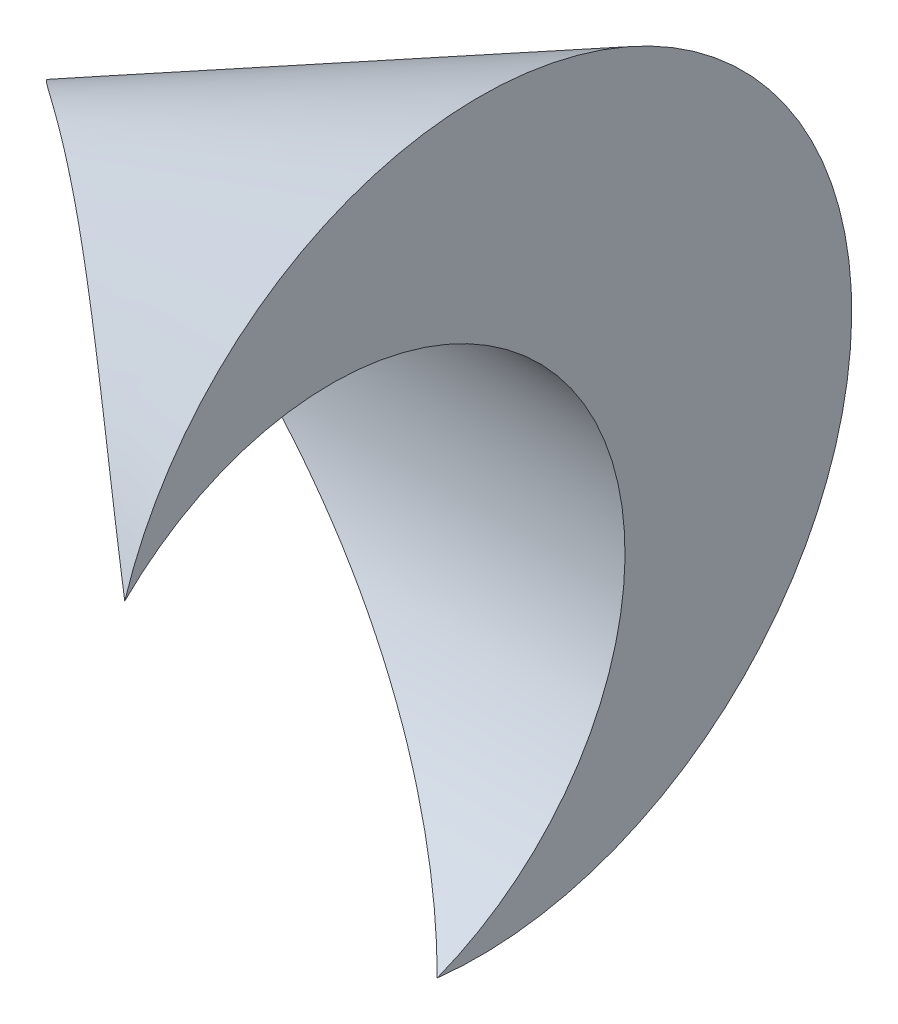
from build123d import *

# Parameters (mm, degrees)
CUT_EXTRUDE_START   = -50
SKETCH_3_R          = 19.723642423
CUT_EXTRUDE_2_DEPTH = 50


with BuildPart() as part:
    # Sketch 1 → Revolve 1 (revolve)
    with BuildSketch(Plane.XY, mode=Mode.PRIVATE) as revolve_1_sk:
        Polygon((-47.998529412, 0), (2.001470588, 25), (2.001470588, 0), align=None)
    revolve(revolve_1_sk.sketch.rotate(Axis((-69.289705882, 0, 0), (1, 0, 0)), 270), axis=Axis((-69.289705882, 0, 0), (1, 0, 0)))

    # Sketch 3 → Cut-Extrude 2 (cut)
    with BuildSketch(Plane(origin=(2.001470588, 0, 0), x_dir=(0, 0, -1), z_dir=(1, 0, 0)).offset(CUT_EXTRUDE_START)):
        with Locations((-9.948096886, -6.439830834)):
            Circle(SKETCH_3_R)
    extrude(amount=CUT_EXTRUDE_2_DEPTH, mode=Mode.SUBTRACT)


solid = part.part
